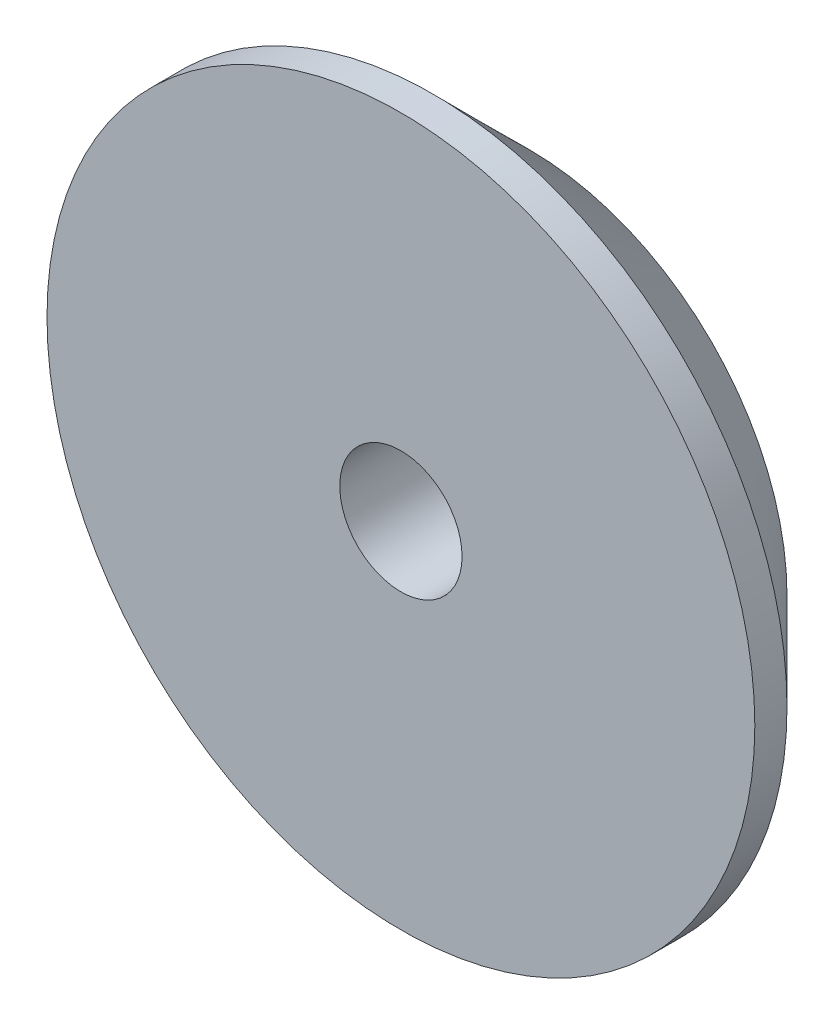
from build123d import *

# Parameters (mm, degrees)
ESQUISSE1_R      = 5.5
ESQUISSE1_R_2    = 0.95
EXTRUSION1_DEPTH = 2
CHANFREIN1_SIZE  = 1.5


with BuildPart() as part:
    # Esquisse1 → Extrusion1 (new body)
    with BuildSketch(Plane.XY):
        Circle(ESQUISSE1_R)
        Circle(ESQUISSE1_R_2, mode=Mode.SUBTRACT)
    extrude(amount=EXTRUSION1_DEPTH)

    # Chanfrein1
    chanfrein1_edges = [part.edges().sort_by_distance(p)[0] for p in [
        (-5.5, 0, 0),
    ]]
    chamfer(chanfrein1_edges, length=CHANFREIN1_SIZE)


solid = part.part
